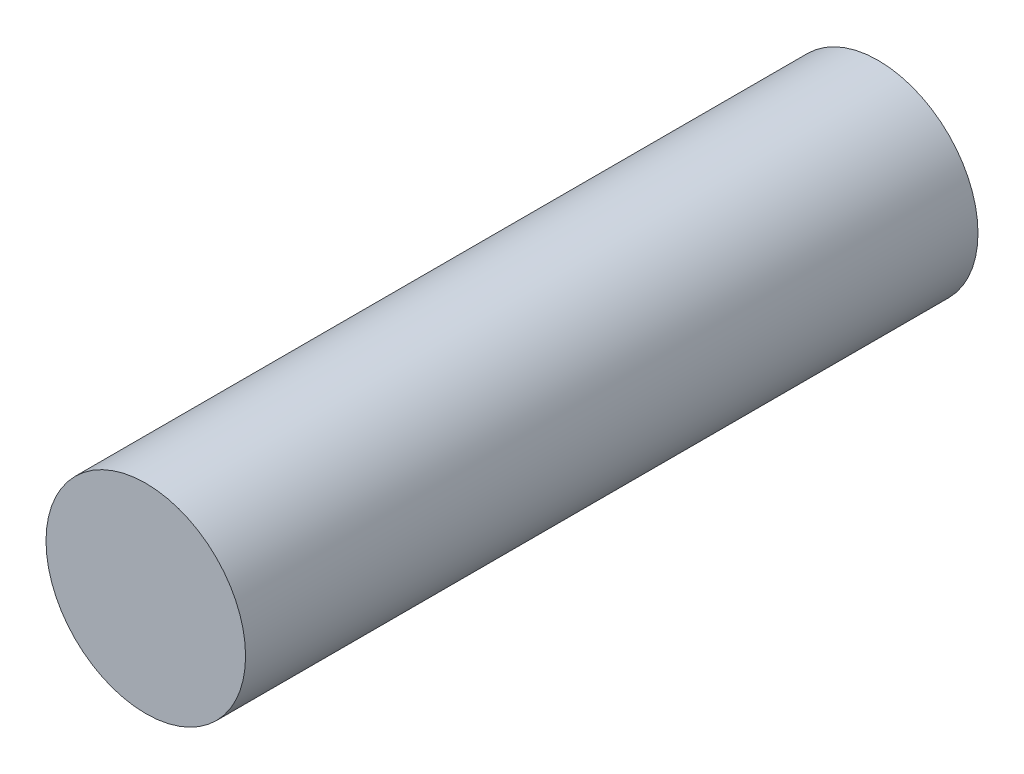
from build123d import *

# Parameters (mm, degrees)
SKETCH1_R          = 2.3876
BASE_EXTRUDE_DEPTH = 17.526


with BuildPart() as part:
    # Sketch1 → Base-Extrude (new body)
    with BuildSketch(Plane.XY):
        Circle(SKETCH1_R)
    extrude(amount=BASE_EXTRUDE_DEPTH)


solid = part.part
